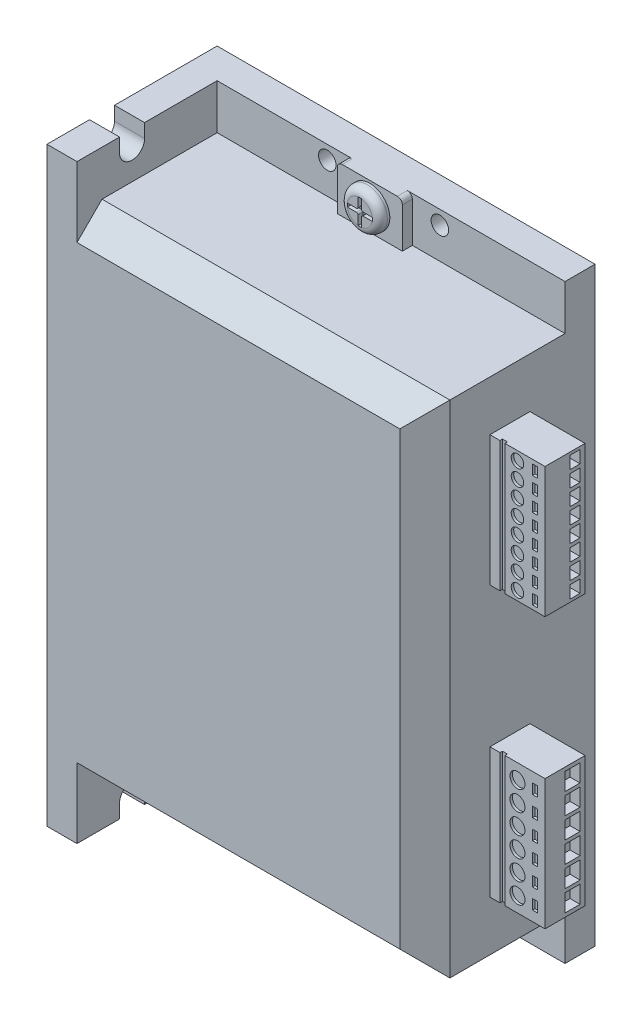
from build123d import *

# Parameters (mm, degrees)
SKETCH1_W           = 75.5
SKETCH1_H           = 118
BOSS_EXTRUDE1_DEPTH = 34
SKETCH2_W           = 69.5
SKETCH2_H           = 9
CUT_EXTRUDE1_DEPTH  = 28
BOSS_EXTRUDE2_DEPTH = 2
DIAMETERHOLE1_D     = 3.5
CUT_EXTRUDE2_DEPTH  = 98.29979445
SKETCH7_R           = 4
BOSS_EXTRUDE3_DEPTH = 2
FILLET1_R           = 1.5
CUT_EXTRUDE3_DEPTH  = 1
SKETCH9_W           = 8
SKETCH9_H           = 26
BOSS_EXTRUDE4_DEPTH = 11
SKETCH10_W          = 2
SKETCH10_H          = 2.5
SKETCH10_W_2        = 3
SKETCH10_H_2        = 3.5
CUT_EXTRUDE4_DEPTH  = 2
SKETCH11_R          = 1.25
SKETCH11_R_2        = 1.5
SKETCH11_W          = 1
SKETCH11_H          = 2
SKETCH11_H_2        = 26
CUT_EXTRUDE5_DEPTH  = 0.5
CHAMFER1_SIZE       = 5


with BuildPart() as part:
    # Sketch1 → Boss-Extrude1 (new body)
    with BuildSketch(Plane.XY):
        with Locations((37.75, 0)):
            Rectangle(SKETCH1_W, SKETCH1_H)
    extrude(amount=BOSS_EXTRUDE1_DEPTH)

    # Sketch2 → Cut-Extrude1 (cut)
    with BuildSketch(Plane.XY.offset(34)):
        with Locations((40.75, 54.5)):
            Rectangle(SKETCH2_W, SKETCH2_H)
        with Locations((40.75, -54.5)):
            Rectangle(SKETCH2_W, SKETCH2_H)
    extrude(amount=-CUT_EXTRUDE1_DEPTH, mode=Mode.SUBTRACT)

    # Sketch3 → Boss-Extrude2 (add)
    with BuildSketch(Plane.XY.offset(6)):
        with BuildLine():
            Line((33, 59), (44, 59))
            ThreePointArc((44, 59), (44.707106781, 58.707106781), (45, 58))
            Line((45, 58), (45, 50))
            Line((45, 50), (32, 50))
            Line((32, 50), (32, 58))
            ThreePointArc((32, 58), (32.292893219, 58.707106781), (33, 59))
        make_face()
        with BuildLine():
            Line((32, -50), (45, -50))
            Line((45, -50), (45, -58))
            ThreePointArc((45, -58), (44.707106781, -58.707106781), (44, -59))
            Line((44, -59), (33, -59))
            ThreePointArc((33, -59), (32.292893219, -58.707106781), (32, -58))
            Line((32, -58), (32, -50))
        make_face()
    extrude(amount=BOSS_EXTRUDE2_DEPTH)

    # DiameterHole1 (through all)
    with Locations(Plane.XY.offset(6)):
        with Locations((28, 56.25), (50.5, 56.25), (50.5, -56.25), (28, -56.25)):
            Hole(DIAMETERHOLE1_D / 2)

    # Sketch6 → Cut-Extrude2 (cut, through all)
    with BuildSketch(Plane(origin=(6, 0, 0), x_dir=(0, 0, -1), z_dir=(1, 0, 0))):
        with BuildLine():
            Line((-25.5, 56.25), (-25.5, 59))
            ThreePointArc((-25.5, 59), (-23, 61.5), (-20.5, 59))
            Line((-20.5, 59), (-20.5, 56.25))
            ThreePointArc((-20.5, 56.25), (-23, 53.75), (-25.5, 56.25))
        make_face()
        with BuildLine():
            Line((-20.5, -56.25), (-20.5, -59))
            ThreePointArc((-20.5, -59), (-23, -61.5), (-25.5, -59))
            Line((-25.5, -59), (-25.5, -56.25))
            ThreePointArc((-25.5, -56.25), (-23, -53.75), (-20.5, -56.25))
        make_face()
    extrude(amount=-CUT_EXTRUDE2_DEPTH, mode=Mode.SUBTRACT)

    # Sketch7 → Boss-Extrude3 (add)
    with BuildSketch(Plane.XY.offset(8)):
        with Locations(Location((38.5, 54.5, 0), (0, 0, 180))):
            Circle(SKETCH7_R)
        with Locations(Location((38.5, -54.5, 0), (0, 0, 180))):
            Circle(SKETCH7_R)
    extrude(amount=BOSS_EXTRUDE3_DEPTH)

    # Fillet1
    fillet1_edges = [part.edges().sort_by_distance(p)[0] for p in [
        (42.5, 54.5, 10),
        (42.5, -54.5, 10),
    ]]
    fillet(fillet1_edges, radius=FILLET1_R)

    # Sketch8 → Cut-Extrude3 (cut)
    with BuildSketch(Plane.XY.offset(10)):
        with BuildLine():
            Line((36, 54.85), (37.85, 54.85))
            ThreePointArc((37.85, 54.85), (38.062132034, 54.937867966), (38.15, 55.15))
            Line((38.15, 55.15), (38.15, 57))
            Line((38.15, 57), (38.85, 57))
            Line((38.85, 57), (38.85, 55.15))
            ThreePointArc((38.85, 55.15), (38.937867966, 54.937867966), (39.15, 54.85))
            Line((39.15, 54.85), (41, 54.85))
            Line((41, 54.85), (41, 54.15))
            Line((41, 54.15), (39.15, 54.15))
            ThreePointArc((39.15, 54.15), (38.937867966, 54.062132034), (38.85, 53.85))
            Line((38.85, 53.85), (38.85, 52))
            Line((38.85, 52), (38.15, 52))
            Line((38.15, 52), (38.15, 53.85))
            ThreePointArc((38.15, 53.85), (38.062132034, 54.062132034), (37.85, 54.15))
            Line((37.85, 54.15), (36, 54.15))
            Line((36, 54.15), (36, 54.85))
        make_face()
        with BuildLine():
            Line((39.15, -54.85), (41, -54.85))
            Line((41, -54.85), (41, -54.15))
            Line((41, -54.15), (39.15, -54.15))
            ThreePointArc((39.15, -54.15), (38.937867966, -54.062132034), (38.85, -53.85))
            Line((38.85, -53.85), (38.85, -52))
            Line((38.85, -52), (38.15, -52))
            Line((38.15, -52), (38.15, -53.85))
            ThreePointArc((38.15, -53.85), (38.062132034, -54.062132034), (37.85, -54.15))
            Line((37.85, -54.15), (36, -54.15))
            Line((36, -54.15), (36, -54.85))
            Line((36, -54.85), (37.85, -54.85))
            ThreePointArc((37.85, -54.85), (38.062132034, -54.937867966), (38.15, -55.15))
            Line((38.15, -55.15), (38.15, -57))
            Line((38.15, -57), (38.85, -57))
            Line((38.85, -57), (38.85, -55.15))
            ThreePointArc((38.85, -55.15), (38.937867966, -54.937867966), (39.15, -54.85))
        make_face()
    extrude(amount=-CUT_EXTRUDE3_DEPTH, mode=Mode.SUBTRACT)

    # Sketch9 → Boss-Extrude4 (add)
    with BuildSketch(Plane(origin=(75.5, 0, 0), x_dir=(0, 0, -1), z_dir=(1, 0, 0))):
        with Locations((-17, 27)):
            Rectangle(SKETCH9_W, SKETCH9_H)
        with Locations((-17, -27)):
            Rectangle(SKETCH9_W, SKETCH9_H)
    extrude(amount=BOSS_EXTRUDE4_DEPTH)

    # Sketch10 → Cut-Extrude4 (cut)
    with BuildSketch(Plane(origin=(86.5, 0, 0), x_dir=(0, 0, -1), z_dir=(1, 0, 0))):
        with Locations((-15, 38.2)):
            Rectangle(SKETCH10_W, SKETCH10_H)
        with Locations((-15, 35)):
            Rectangle(SKETCH10_W, SKETCH10_H)
        with Locations((-15, 31.8)):
            Rectangle(SKETCH10_W, SKETCH10_H)
        with Locations((-15, 28.6)):
            Rectangle(SKETCH10_W, SKETCH10_H)
        with Locations((-15, 25.4)):
            Rectangle(SKETCH10_W, SKETCH10_H)
        with Locations((-15, 22.2)):
            Rectangle(SKETCH10_W, SKETCH10_H)
        with Locations((-15, 19)):
            Rectangle(SKETCH10_W, SKETCH10_H)
        with Locations((-15.5, -16.5)):
            Rectangle(SKETCH10_W_2, SKETCH10_H_2)
        with Locations((-15, 15.8)):
            Rectangle(SKETCH10_W, SKETCH10_H)
        with Locations((-15.5, -20.7)):
            Rectangle(SKETCH10_W_2, SKETCH10_H_2)
        with Locations((-15.5, -24.9)):
            Rectangle(SKETCH10_W_2, SKETCH10_H_2)
        with Locations((-15.5, -29.1)):
            Rectangle(SKETCH10_W_2, SKETCH10_H_2)
        with Locations((-15.5, -33.3)):
            Rectangle(SKETCH10_W_2, SKETCH10_H_2)
        with Locations((-15.5, -37.5)):
            Rectangle(SKETCH10_W_2, SKETCH10_H_2)
    extrude(amount=-CUT_EXTRUDE4_DEPTH, mode=Mode.SUBTRACT)

    # Sketch11 → Cut-Extrude5 (cut)
    with BuildSketch(Plane.XY.offset(21)):
        with Locations((81, 38.2)):
            Circle(SKETCH11_R)
        with Locations((81, 35)):
            Circle(SKETCH11_R)
        with Locations((81, 31.8)):
            Circle(SKETCH11_R)
        with Locations((81, 28.6)):
            Circle(SKETCH11_R)
        with Locations((81, 25.4)):
            Circle(SKETCH11_R)
        with Locations((81, 22.2)):
            Circle(SKETCH11_R)
        with Locations((81, 19)):
            Circle(SKETCH11_R)
        with Locations((81, 15.8)):
            Circle(SKETCH11_R)
        with Locations((81, -17)):
            Circle(SKETCH11_R_2)
        with Locations((81, -21)):
            Circle(SKETCH11_R_2)
        with Locations((81, -25)):
            Circle(SKETCH11_R_2)
        with Locations((81, -29)):
            Circle(SKETCH11_R_2)
        with Locations((81, -33)):
            Circle(SKETCH11_R_2)
        with Locations((81, -37)):
            Circle(SKETCH11_R_2)
        with Locations((84.5, 35)):
            Rectangle(SKETCH11_W, SKETCH11_H)
        with Locations((84.5, 38.2)):
            Rectangle(SKETCH11_W, SKETCH11_H)
        with Locations((84.5, 31.8)):
            Rectangle(SKETCH11_W, SKETCH11_H)
        with Locations((84.5, 28.6)):
            Rectangle(SKETCH11_W, SKETCH11_H)
        with Locations((84.5, 25.4)):
            Rectangle(SKETCH11_W, SKETCH11_H)
        with Locations((84.5, 22.2)):
            Rectangle(SKETCH11_W, SKETCH11_H)
        with Locations((78, 27)):
            Rectangle(SKETCH11_W, SKETCH11_H_2)
        with Locations((78, -27)):
            Rectangle(SKETCH11_W, SKETCH11_H_2)
        with Locations((84.5, 19)):
            Rectangle(SKETCH11_W, SKETCH11_H)
        with Locations((84.5, 15.8)):
            Rectangle(SKETCH11_W, SKETCH11_H)
        with Locations((84.5, -17)):
            Rectangle(SKETCH11_W, SKETCH11_H)
        with Locations((84.5, -21)):
            Rectangle(SKETCH11_W, SKETCH11_H)
        with Locations((84.5, -25)):
            Rectangle(SKETCH11_W, SKETCH11_H)
        with Locations((84.5, -29)):
            Rectangle(SKETCH11_W, SKETCH11_H)
        with Locations((84.5, -33)):
            Rectangle(SKETCH11_W, SKETCH11_H)
        with Locations((84.5, -37)):
            Rectangle(SKETCH11_W, SKETCH11_H)
    extrude(amount=-CUT_EXTRUDE5_DEPTH, mode=Mode.SUBTRACT)

    # Chamfer1
    chamfer1_edges = [part.edges().sort_by_distance(p)[0] for p in [
        (40.75, 50, 34),
        (75.5, 0, 34),
        (40.75, -50, 34),
    ]]
    chamfer(chamfer1_edges, length=CHAMFER1_SIZE)


solid = part.part
